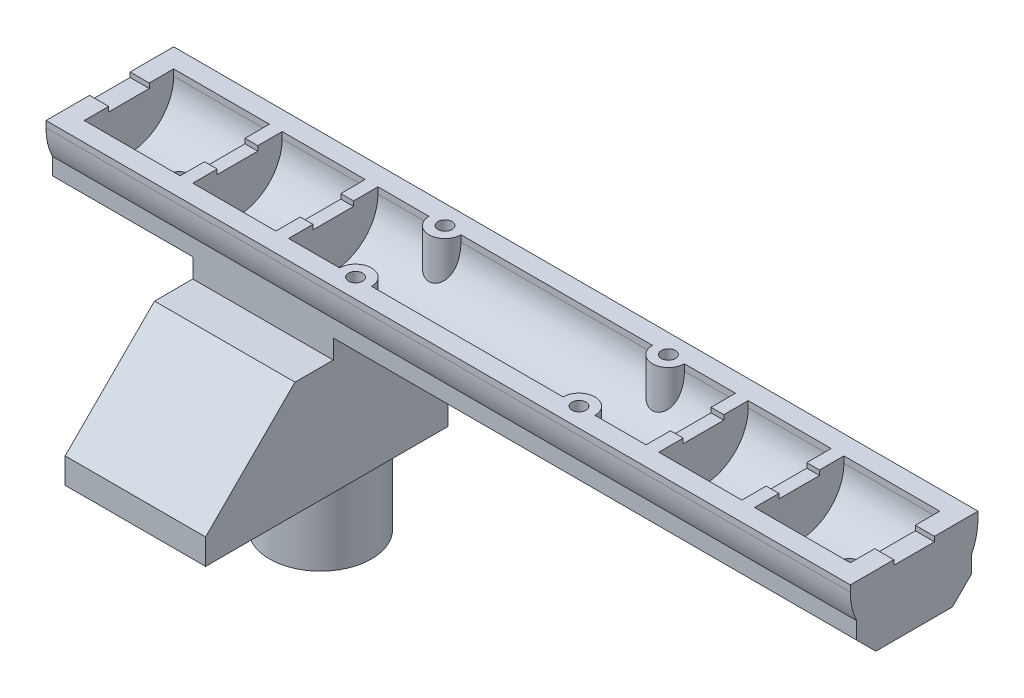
from build123d import *

# Parameters (mm, degrees)
BOSS_EXTRUDE1_DEPTH       = 120
SKETCH3_R                 = 7.99
BOSS_EXTRUDE2_DEPTH       = 15
BOSS_EXTRUDE3_DEPTH       = 3
SKETCH4_W                 = 126
SKETCH4_H                 = 20
SKETCH4_W_2               = 120
SKETCH4_H_2               = 14
BOSS_EXTRUDE4_DEPTH       = 1
SKETCH7_R                 = 1.7
CUT_EXTRUDE3_DEPTH        = 127.767503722
LPATTERN2_COUNT           = 2
LPATTERN2_PITCH           = 30
SKETCH8_R                 = 1.7
CUT_EXTRUDE4_DEPTH        = 127.767503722
BOSS_EXTRUDE5_DEPTH       = 2
LPATTERN4_COUNT           = 2
LPATTERN4_PITCH           = 15
MIRROR3_COPY_1_DEPTH      = 2
CUT_EXTRUDE5_REACH        = 135.51
SKETCH9_W                 = 6.35
SKETCH9_H                 = 0.75
SKETCH10_W                = 82
SKETCH10_H                = 18
SKETCH10_W_2              = 22
CUT_EXTRUDE6_DEPTH        = 132.677636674
BOSS_EXTRUDE6_REACH       = 133.015
SKETCH12_R                = 1.1
CUT_EXTRUDE7_DEPTH        = 1.7
LPATTERN5_COUNT           = 2
LPATTERN5_PITCH           = 35
LPATTERN5_COPY_1_REACH    = 133.015
LPATTERN5_COPY_2_SKETCH_R = 1.1
LPATTERN5_COPY_2_DEPTH    = 1.7
CHAMFER1_SIZE             = 3
SKETCH13_W                = 22
SKETCH13_H                = 18
BOSS_EXTRUDE7_DEPTH       = 20
CHAMFER2_SIZE             = 14


with BuildPart() as part:
    # Sketch1 → Boss-Extrude1 (new body)
    with BuildSketch(Plane(origin=(0, 0, 0), x_dir=(0, 0, -1), z_dir=(1, 0, 0))):
        with BuildLine():
            ThreePointArc((-7, 0), (0, -7), (7, 0))
            Line((7, 0), (10, 0))
            ThreePointArc((10, 0), (0, -10), (-10, 0))
            Line((-10, 0), (-7, 0))
        make_face()
        with BuildLine():
            ThreePointArc((9, -4.358898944), (0, -10), (-9, -4.358898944))
            Line((-9, -4.358898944), (-9, -28))
            Line((-9, -28), (9, -28))
            Line((9, -28), (9, -4.358898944))
        make_face()
    extrude(amount=BOSS_EXTRUDE1_DEPTH)

    # Sketch3 → Boss-Extrude2 (add)
    with BuildSketch(Plane.XZ.offset(28)):
        with Locations(Location((30, 0, 0), (0, 0, 270))):
            Circle(SKETCH3_R)
    extrude(amount=BOSS_EXTRUDE2_DEPTH)

    # Sketch2 → Boss-Extrude3 (add)
    with BuildSketch(Plane(origin=(120, 0, 0), x_dir=(0, 0, -1), z_dir=(1, 0, 0))):
        with BuildLine():
            ThreePointArc((9, -4.358898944), (0, -10), (-9, -4.358898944))
            Line((-9, -4.358898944), (-9, -28))
            Line((-9, -28), (9, -28))
            Line((9, -28), (9, -4.358898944))
        make_face()
        with BuildLine():
            Line((-7, 0), (-10, 0))
            ThreePointArc((-10, 0), (-9.746794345, -2.236067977), (-9, -4.358898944))
            ThreePointArc((-9, -4.358898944), (0, -10), (9, -4.358898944))
            ThreePointArc((9, -4.358898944), (9.746794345, -2.236067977), (10, 0))
            Line((10, 0), (7, 0))
            ThreePointArc((7, 0), (0, -7), (-7, 0))
        make_face()
        with BuildLine():
            Line((7, 0), (-7, 0))
            ThreePointArc((-7, 0), (0, -7), (7, 0))
        make_face()
    boss_extrude3 = extrude(amount=BOSS_EXTRUDE3_DEPTH)

    # Mirror1: Boss-Extrude3 across plane
    add(boss_extrude3.mirror(Plane(origin=(60, 0, 0), x_dir=(0, 0, 1), z_dir=(1, 0, 0))))

    # Sketch4 → Boss-Extrude4 (add)
    with BuildSketch(Plane(origin=(0, 0, 0), x_dir=(1, 0, 0), z_dir=(0, 1, 0))):
        with Locations((60, 0)):
            Rectangle(SKETCH4_W, SKETCH4_H)
        with Locations((60, 0)):
            Rectangle(SKETCH4_W_2, SKETCH4_H_2, mode=Mode.SUBTRACT)
    extrude(amount=BOSS_EXTRUDE4_DEPTH)

    # Sketch7 → Cut-Extrude3 (cut, through all)
    with BuildSketch(Plane.XZ.offset(28)):
        with Locations(Location((112.5, 0, 0), (0, 0, 270))):
            Circle(SKETCH7_R)
    cut_extrude3 = extrude(amount=-CUT_EXTRUDE3_DEPTH, mode=Mode.SUBTRACT)

    # LPattern2: Cut-Extrude3 ×2
    with Locations(*[(-i * LPATTERN2_PITCH, 0, 0) for i in range(1, LPATTERN2_COUNT)]):
        add(cut_extrude3, mode=Mode.SUBTRACT)

    # Sketch8 → Cut-Extrude4 (cut, through all)
    with BuildSketch(Plane.XZ.offset(28)):
        with Locations(Location((7.5, 0, 0), (0, 0, 270))):
            Circle(SKETCH8_R)
    extrude(amount=-CUT_EXTRUDE4_DEPTH, mode=Mode.SUBTRACT)

    # Sketch6 → Boss-Extrude5 (add)
    with BuildSketch(Plane(origin=(15, 0, 0), x_dir=(0, 0, -1), z_dir=(1, 0, 0))):
        with BuildLine():
            Line((9, 1), (9, 0))
            ThreePointArc((9, 0), (0, -9), (-9, 0))
            Line((-9, 0), (-9, 1))
            Line((-9, 1), (-3.175, 1))
            Line((-3.175, 1), (-3.175, 0.25))
            Line((-3.175, 0.25), (3.175, 0.25))
            Line((3.175, 0.25), (3.175, 1))
            Line((3.175, 1), (9, 1))
        make_face()
    boss_extrude5 = extrude(amount=BOSS_EXTRUDE5_DEPTH)

    # LPattern4: Boss-Extrude5 ×2
    with Locations(*[(i * LPATTERN4_PITCH, 0, 0) for i in range(1, LPATTERN4_COUNT)]):
        add(boss_extrude5)

    # Mirror3: Boss-Extrude5 across plane
    add(boss_extrude5.mirror(Plane(origin=(60, 0, 0), x_dir=(0, 0, 1), z_dir=(1, 0, 0))))

    # Mirror3 copy 1 sketch → Mirror3 copy 1 (add)
    with BuildSketch(Plane(origin=(90, 0, 0), x_dir=(0, 0, -1), z_dir=(-1, 0, 0))):
        with BuildLine():
            Line((9, -1), (9, 0))
            ThreePointArc((9, 0), (0, 9), (-9, 0))
            Line((-9, 0), (-9, -1))
            Line((-9, -1), (-3.175, -1))
            Line((-3.175, -1), (-3.175, -0.25))
            Line((-3.175, -0.25), (3.175, -0.25))
            Line((3.175, -0.25), (3.175, -1))
            Line((3.175, -1), (9, -1))
        make_face()
    extrude(amount=MIRROR3_COPY_1_DEPTH)

    # Sketch9 → Cut-Extrude5 (cut, up to next)
    with BuildSketch(Plane(origin=(123, 0, 0), x_dir=(0, 0, -1), z_dir=(1, 0, 0)), mode=Mode.PRIVATE) as cut_extrude5_sk1:
        with Locations((0, 0.625)):
            Rectangle(SKETCH9_W, SKETCH9_H)
    cut_extrude5_tool1 = extrude(cut_extrude5_sk1.sketch, amount=-CUT_EXTRUDE5_REACH, mode=Mode.PRIVATE) & part.part
    cut_extrude5 = cut_extrude5_tool1.solids().sort_by_distance((123, 0.625, 0))[0]
    add(cut_extrude5, mode=Mode.SUBTRACT)

    # Mirror4: Cut-Extrude5 across plane
    add(cut_extrude5.mirror(Plane(origin=(60, 0, 0), x_dir=(0, 0, 1), z_dir=(1, 0, 0))), mode=Mode.SUBTRACT)

    # Sketch10 → Cut-Extrude6 (cut, through all)
    with BuildSketch(Plane.XY.offset(9)):
        with Locations((82, -19)):
            Rectangle(SKETCH10_W, SKETCH10_H)
        with Locations((8, -19)):
            Rectangle(SKETCH10_W_2, SKETCH10_H)
    extrude(amount=-CUT_EXTRUDE6_DEPTH, mode=Mode.SUBTRACT)

    # Sketch11 → Boss-Extrude6 (add, up to next)
    with BuildSketch(Plane(origin=(0, 1, 0), x_dir=(1, 0, 0), z_dir=(0, 1, 0)), mode=Mode.PRIVATE) as boss_extrude6_sk1:
        with BuildLine():
            Line((40, -7), (45, -7))
            ThreePointArc((45, -7), (42.5, -4.5), (40, -7))
        make_face()
    boss_extrude6_tool1 = extrude(boss_extrude6_sk1.sketch, amount=-BOSS_EXTRUDE6_REACH, mode=Mode.PRIVATE) - part.part
    boss_extrude6 = boss_extrude6_tool1.solids().sort_by_distance((42.5, 1, 5.938967))[0]
    add(boss_extrude6)

    # Sketch12 → Cut-Extrude7 (cut)
    with BuildSketch(Plane(origin=(0, 1, 0), x_dir=(1, 0, 0), z_dir=(0, 1, 0))):
        with Locations(Location((42.5, -7, 0), (0, 0, 270))):
            Circle(SKETCH12_R)
    cut_extrude7 = extrude(amount=-CUT_EXTRUDE7_DEPTH, mode=Mode.SUBTRACT)

    # Mirror5: Boss-Extrude6, Cut-Extrude7 across plane
    add(boss_extrude6.mirror(Plane.XY))
    add(cut_extrude7.mirror(Plane.XY), mode=Mode.SUBTRACT)

    # LPattern5: Boss-Extrude6, Cut-Extrude7 ×2
    with Locations(*[(i * LPATTERN5_PITCH, 0, 0) for i in range(1, LPATTERN5_COUNT)]):
        add(boss_extrude6)
        add(cut_extrude7, mode=Mode.SUBTRACT)

    # LPattern5 copy 1 sketch → LPattern5 copy 1 (add, up to next)
    with BuildSketch(Plane(origin=(35, 1, 0), x_dir=(1, 0, 0), z_dir=(0, 1, 0)), mode=Mode.PRIVATE) as lpattern5_copy_1_sk1:
        with BuildLine():
            Line((40, 7), (45, 7))
            ThreePointArc((45, 7), (42.5, 4.5), (40, 7))
        make_face()
    lpattern5_copy_1_tool1 = extrude(lpattern5_copy_1_sk1.sketch, amount=-LPATTERN5_COPY_1_REACH, mode=Mode.PRIVATE) - part.part
    add(lpattern5_copy_1_tool1.solids().sort_by_distance((77.5, 1, -5.938967))[0])

    # LPattern5 copy 2 sketch → LPattern5 copy 2 (cut)
    with BuildSketch(Plane(origin=(35, 1, 0), x_dir=(1, 0, 0), z_dir=(0, 1, 0))):
        with Locations((42.5, 7)):
            Circle(LPATTERN5_COPY_2_SKETCH_R)
    extrude(amount=-LPATTERN5_COPY_2_DEPTH, mode=Mode.SUBTRACT)

    # Chamfer1
    chamfer1_edges = [part.edges().sort_by_distance(p)[0] for p in [
        (82, -10, -9),
        (82, -10, 9),
        (8, -10, -9),
        (8, -10, 9),
    ]]
    chamfer(chamfer1_edges, length=CHAMFER1_SIZE)

    # Sketch13 → Boss-Extrude7 (add)
    with BuildSketch(Plane.XY.offset(9)):
        with Locations((30, -19)):
            Rectangle(SKETCH13_W, SKETCH13_H)
    extrude(amount=BOSS_EXTRUDE7_DEPTH)

    # Chamfer2
    chamfer2_edges = [part.edges().sort_by_distance(p)[0] for p in [
        (30, -10, 29),
    ]]
    chamfer(chamfer2_edges, length=CHAMFER2_SIZE)


solid = part.part
